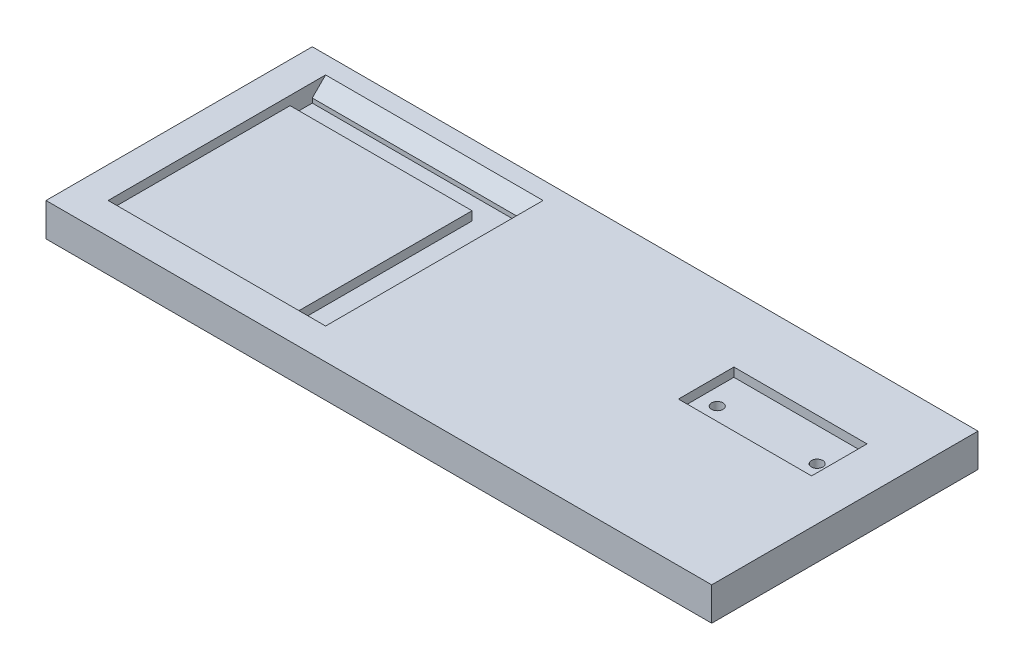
ISO-10303-21;
HEADER;
FILE_DESCRIPTION(('STEP AP214'),'2;1');
FILE_NAME('part.step','',(''),(''),'','','');
FILE_SCHEMA(('AUTOMOTIVE_DESIGN { 1 0 10303 214 1 1 1 1 }'));
ENDSEC;
DATA;
#1=APPLICATION_CONTEXT('core data for automotive mechanical design processes');
#2=APPLICATION_PROTOCOL_DEFINITION('international standard','automotive_design',2000,#1);
#3=PRODUCT_CONTEXT('',#1,'mechanical');
#4=PRODUCT('Part','Part','',(#3));
#5=PRODUCT_RELATED_PRODUCT_CATEGORY('part','',(#4));
#6=PRODUCT_DEFINITION_FORMATION('','',#4);
#7=PRODUCT_DEFINITION_CONTEXT('part definition',#1,'design');
#8=PRODUCT_DEFINITION('design','',#6,#7);
#9=PRODUCT_DEFINITION_SHAPE('','',#8);
#10=(LENGTH_UNIT() NAMED_UNIT(*) SI_UNIT(.MILLI.,.METRE.));
#11=(NAMED_UNIT(*) PLANE_ANGLE_UNIT() SI_UNIT($,.RADIAN.));
#12=(NAMED_UNIT(*) SI_UNIT($,.STERADIAN.) SOLID_ANGLE_UNIT());
#13=UNCERTAINTY_MEASURE_WITH_UNIT(LENGTH_MEASURE(1.E-05),#10,'distance_accuracy_value','');
#14=(GEOMETRIC_REPRESENTATION_CONTEXT(3) GLOBAL_UNCERTAINTY_ASSIGNED_CONTEXT((#13)) GLOBAL_UNIT_ASSIGNED_CONTEXT((#10,
#11,#12)) REPRESENTATION_CONTEXT('',''));
#15=CARTESIAN_POINT('',(0.,0.,0.));
#16=DIRECTION('',(0.,0.,1.));
#17=DIRECTION('',(1.,0.,0.));
#18=AXIS2_PLACEMENT_3D('',#15,#16,#17);
#19=CARTESIAN_POINT('',(190.5,19.05,-76.2));
#20=DIRECTION('',(0.,-1.,0.));
#21=DIRECTION('',(0.,0.,-1.));
#22=AXIS2_PLACEMENT_3D('',#19,#20,#21);
#23=PLANE('',#22);
#24=DIRECTION('',(-1.,0.,0.));
#25=VECTOR('',#24,1.);
#26=CARTESIAN_POINT('',(88.8999999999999,19.05,-38.1));
#27=LINE('',#26,#25);
#28=CARTESIAN_POINT('',(165.1,19.05,-38.1));
#29=VERTEX_POINT('',#28);
#30=CARTESIAN_POINT('',(88.8999999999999,19.05,-38.1));
#31=VERTEX_POINT('',#30);
#32=EDGE_CURVE('E257',#29,#31,#27,.T.);
#33=ORIENTED_EDGE('',*,*,#32,.F.);
#34=DIRECTION('',(0.,0.,-1.));
#35=VECTOR('',#34,1.);
#36=CARTESIAN_POINT('',(165.1,19.05,-6.35000000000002));
#37=LINE('',#36,#35);
#38=CARTESIAN_POINT('',(165.1,19.05,-6.35000000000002));
#39=VERTEX_POINT('',#38);
#40=EDGE_CURVE('E255',#39,#29,#37,.T.);
#41=ORIENTED_EDGE('',*,*,#40,.F.);
#42=DIRECTION('',(1.,0.,0.));
#43=VECTOR('',#42,1.);
#44=CARTESIAN_POINT('',(88.8999999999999,19.05,-6.35000000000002));
#45=LINE('',#44,#43);
#46=CARTESIAN_POINT('',(88.8999999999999,19.05,-6.35000000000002));
#47=VERTEX_POINT('',#46);
#48=EDGE_CURVE('E243',#47,#39,#45,.T.);
#49=ORIENTED_EDGE('',*,*,#48,.F.);
#50=DIRECTION('',(0.,0.,1.));
#51=VECTOR('',#50,1.);
#52=CARTESIAN_POINT('',(88.8999999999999,19.05,-6.35000000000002));
#53=LINE('',#52,#51);
#54=EDGE_CURVE('E261',#31,#47,#53,.T.);
#55=ORIENTED_EDGE('',*,*,#54,.F.);
#56=EDGE_LOOP('',(#33,#41,#49,#55));
#57=FACE_BOUND('',#56,.T.);
#58=DIRECTION('',(0.,0.,-1.));
#59=VECTOR('',#58,1.);
#60=CARTESIAN_POINT('',(190.5,19.05,76.2));
#61=LINE('',#60,#59);
#62=CARTESIAN_POINT('',(190.5,19.05,76.2));
#63=VERTEX_POINT('',#62);
#64=CARTESIAN_POINT('',(190.5,19.05,-76.2));
#65=VERTEX_POINT('',#64);
#66=EDGE_CURVE('E278',#63,#65,#61,.T.);
#67=ORIENTED_EDGE('',*,*,#66,.T.);
#68=DIRECTION('',(-1.,0.,0.));
#69=VECTOR('',#68,1.);
#70=CARTESIAN_POINT('',(-190.5,19.05,-76.2));
#71=LINE('',#70,#69);
#72=CARTESIAN_POINT('',(-190.5,19.05,-76.2));
#73=VERTEX_POINT('',#72);
#74=EDGE_CURVE('E281',#65,#73,#71,.T.);
#75=ORIENTED_EDGE('',*,*,#74,.T.);
#76=DIRECTION('',(0.,0.,1.));
#77=VECTOR('',#76,1.);
#78=CARTESIAN_POINT('',(-190.5,19.05,76.2));
#79=LINE('',#78,#77);
#80=CARTESIAN_POINT('',(-190.5,19.05,76.2));
#81=VERTEX_POINT('',#80);
#82=EDGE_CURVE('E284',#73,#81,#79,.T.);
#83=ORIENTED_EDGE('',*,*,#82,.T.);
#84=DIRECTION('',(1.,0.,0.));
#85=VECTOR('',#84,1.);
#86=CARTESIAN_POINT('',(-190.5,19.05,76.2));
#87=LINE('',#86,#85);
#88=EDGE_CURVE('E286',#81,#63,#87,.T.);
#89=ORIENTED_EDGE('',*,*,#88,.T.);
#90=EDGE_LOOP('',(#67,#75,#83,#89));
#91=FACE_BOUND('',#90,.T.);
#92=DIRECTION('',(0.,0.,1.));
#93=VECTOR('',#92,1.);
#94=CARTESIAN_POINT('',(-48.26,19.05,-76.2));
#95=LINE('',#94,#93);
#96=CARTESIAN_POINT('',(-48.26,19.05,-66.04));
#97=VERTEX_POINT('',#96);
#98=CARTESIAN_POINT('',(-48.26,19.05,58.42));
#99=VERTEX_POINT('',#98);
#100=EDGE_CURVE('E316',#97,#99,#95,.T.);
#101=ORIENTED_EDGE('',*,*,#100,.T.);
#102=DIRECTION('',(1.,0.,0.));
#103=VECTOR('',#102,1.);
#104=CARTESIAN_POINT('',(-319.318472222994,19.05,58.42));
#105=LINE('',#104,#103);
#106=CARTESIAN_POINT('',(-172.72,19.05,58.42));
#107=VERTEX_POINT('',#106);
#108=EDGE_CURVE('E65',#107,#99,#105,.T.);
#109=ORIENTED_EDGE('',*,*,#108,.F.);
#110=DIRECTION('',(0.,0.,-1.));
#111=VECTOR('',#110,1.);
#112=CARTESIAN_POINT('',(-172.72,19.05,0.));
#113=LINE('',#112,#111);
#114=CARTESIAN_POINT('',(-172.72,19.05,-66.04));
#115=VERTEX_POINT('',#114);
#116=EDGE_CURVE('E196',#107,#115,#113,.T.);
#117=ORIENTED_EDGE('',*,*,#116,.T.);
#118=DIRECTION('',(1.,0.,0.));
#119=VECTOR('',#118,1.);
#120=CARTESIAN_POINT('',(-55.88,19.05,-66.04));
#121=LINE('',#120,#119);
#122=EDGE_CURVE('E314',#115,#97,#121,.T.);
#123=ORIENTED_EDGE('',*,*,#122,.T.);
#124=EDGE_LOOP('',(#101,#109,#117,#123));
#125=FACE_BOUND('',#124,.T.);
#126=ADVANCED_FACE('F41',(#57,#91,#125),#23,.F.);
#127=CARTESIAN_POINT('',(190.5,19.05,76.2));
#128=DIRECTION('',(-1.,0.,0.));
#129=DIRECTION('',(0.,0.,1.));
#130=AXIS2_PLACEMENT_3D('',#127,#128,#129);
#131=PLANE('',#130);
#132=DIRECTION('',(0.,0.,-1.));
#133=VECTOR('',#132,1.);
#134=CARTESIAN_POINT('',(190.5,0.,76.2));
#135=LINE('',#134,#133);
#136=CARTESIAN_POINT('',(190.5,0.,76.2));
#137=VERTEX_POINT('',#136);
#138=CARTESIAN_POINT('',(190.5,0.,-76.2));
#139=VERTEX_POINT('',#138);
#140=EDGE_CURVE('E270',#137,#139,#135,.T.);
#141=ORIENTED_EDGE('',*,*,#140,.T.);
#142=DIRECTION('',(0.,-1.,0.));
#143=VECTOR('',#142,1.);
#144=CARTESIAN_POINT('',(190.5,19.05,-76.2));
#145=LINE('',#144,#143);
#146=EDGE_CURVE('E304',#65,#139,#145,.T.);
#147=ORIENTED_EDGE('',*,*,#146,.F.);
#148=ORIENTED_EDGE('',*,*,#66,.F.);
#149=DIRECTION('',(0.,-1.,0.));
#150=VECTOR('',#149,1.);
#151=CARTESIAN_POINT('',(190.5,19.05,76.2));
#152=LINE('',#151,#150);
#153=EDGE_CURVE('E288',#63,#137,#152,.T.);
#154=ORIENTED_EDGE('',*,*,#153,.T.);
#155=EDGE_LOOP('',(#141,#147,#148,#154));
#156=FACE_BOUND('',#155,.T.);
#157=ADVANCED_FACE('F351',(#156),#131,.F.);
#158=CARTESIAN_POINT('',(-190.5,19.05,-76.2));
#159=DIRECTION('',(0.,0.,1.));
#160=DIRECTION('',(1.,0.,0.));
#161=AXIS2_PLACEMENT_3D('',#158,#159,#160);
#162=PLANE('',#161);
#163=DIRECTION('',(-1.,0.,0.));
#164=VECTOR('',#163,1.);
#165=CARTESIAN_POINT('',(-190.5,0.,-76.2));
#166=LINE('',#165,#164);
#167=CARTESIAN_POINT('',(-190.5,0.,-76.2));
#168=VERTEX_POINT('',#167);
#169=EDGE_CURVE('E291',#139,#168,#166,.T.);
#170=ORIENTED_EDGE('',*,*,#169,.T.);
#171=DIRECTION('',(0.,-1.,0.));
#172=VECTOR('',#171,1.);
#173=CARTESIAN_POINT('',(-190.5,19.05,-76.2));
#174=LINE('',#173,#172);
#175=EDGE_CURVE('E301',#73,#168,#174,.T.);
#176=ORIENTED_EDGE('',*,*,#175,.F.);
#177=ORIENTED_EDGE('',*,*,#74,.F.);
#178=ORIENTED_EDGE('',*,*,#146,.T.);
#179=EDGE_LOOP('',(#170,#176,#177,#178));
#180=FACE_BOUND('',#179,.T.);
#181=ADVANCED_FACE('F357',(#180),#162,.F.);
#182=CARTESIAN_POINT('',(-190.5,19.05,76.2));
#183=DIRECTION('',(1.,0.,0.));
#184=DIRECTION('',(0.,0.,-1.));
#185=AXIS2_PLACEMENT_3D('',#182,#183,#184);
#186=PLANE('',#185);
#187=DIRECTION('',(0.,0.,1.));
#188=VECTOR('',#187,1.);
#189=CARTESIAN_POINT('',(-190.5,0.,76.2));
#190=LINE('',#189,#188);
#191=CARTESIAN_POINT('',(-190.5,0.,76.2));
#192=VERTEX_POINT('',#191);
#193=EDGE_CURVE('E293',#168,#192,#190,.T.);
#194=ORIENTED_EDGE('',*,*,#193,.T.);
#195=DIRECTION('',(0.,-1.,0.));
#196=VECTOR('',#195,1.);
#197=CARTESIAN_POINT('',(-190.5,19.05,76.2));
#198=LINE('',#197,#196);
#199=EDGE_CURVE('E298',#81,#192,#198,.T.);
#200=ORIENTED_EDGE('',*,*,#199,.F.);
#201=ORIENTED_EDGE('',*,*,#82,.F.);
#202=ORIENTED_EDGE('',*,*,#175,.T.);
#203=EDGE_LOOP('',(#194,#200,#201,#202));
#204=FACE_BOUND('',#203,.T.);
#205=ADVANCED_FACE('F373',(#204),#186,.F.);
#206=CARTESIAN_POINT('',(-190.5,19.05,76.2));
#207=DIRECTION('',(0.,0.,-1.));
#208=DIRECTION('',(-1.,0.,0.));
#209=AXIS2_PLACEMENT_3D('',#206,#207,#208);
#210=PLANE('',#209);
#211=DIRECTION('',(1.,0.,0.));
#212=VECTOR('',#211,1.);
#213=CARTESIAN_POINT('',(-190.5,0.,76.2));
#214=LINE('',#213,#212);
#215=EDGE_CURVE('E282',#192,#137,#214,.T.);
#216=ORIENTED_EDGE('',*,*,#215,.T.);
#217=ORIENTED_EDGE('',*,*,#153,.F.);
#218=ORIENTED_EDGE('',*,*,#88,.F.);
#219=ORIENTED_EDGE('',*,*,#199,.T.);
#220=EDGE_LOOP('',(#216,#217,#218,#219));
#221=FACE_BOUND('',#220,.T.);
#222=ADVANCED_FACE('F369',(#221),#210,.F.);
#223=CARTESIAN_POINT('',(190.5,0.,-76.2));
#224=DIRECTION('',(0.,-1.,0.));
#225=DIRECTION('',(0.,0.,-1.));
#226=AXIS2_PLACEMENT_3D('',#223,#224,#225);
#227=PLANE('',#226);
#228=CARTESIAN_POINT('',(155.575,0.,-19.05));
#229=DIRECTION('',(0.,-1.,0.));
#230=DIRECTION('',(0.,0.,-1.));
#231=AXIS2_PLACEMENT_3D('',#228,#229,#230);
#232=CIRCLE('',#231,7.14375);
#233=CARTESIAN_POINT('',(155.575,0.,-26.19375));
#234=VERTEX_POINT('',#233);
#235=EDGE_CURVE('E218',#234,#234,#232,.T.);
#236=ORIENTED_EDGE('',*,*,#235,.F.);
#237=EDGE_LOOP('',(#236));
#238=FACE_BOUND('',#237,.T.);
#239=CARTESIAN_POINT('',(98.4249999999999,0.,-19.05));
#240=DIRECTION('',(0.,-1.,0.));
#241=DIRECTION('',(0.,0.,-1.));
#242=AXIS2_PLACEMENT_3D('',#239,#240,#241);
#243=CIRCLE('',#242,7.14375);
#244=CARTESIAN_POINT('',(98.4249999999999,0.,-26.19375));
#245=VERTEX_POINT('',#244);
#246=EDGE_CURVE('E229',#245,#245,#243,.T.);
#247=ORIENTED_EDGE('',*,*,#246,.F.);
#248=EDGE_LOOP('',(#247));
#249=FACE_BOUND('',#248,.T.);
#250=ORIENTED_EDGE('',*,*,#140,.F.);
#251=ORIENTED_EDGE('',*,*,#215,.F.);
#252=ORIENTED_EDGE('',*,*,#193,.F.);
#253=ORIENTED_EDGE('',*,*,#169,.F.);
#254=EDGE_LOOP('',(#250,#251,#252,#253));
#255=FACE_BOUND('',#254,.T.);
#256=ADVANCED_FACE('F366',(#238,#249,#255),#227,.T.);
#257=CARTESIAN_POINT('',(165.1,13.97,-6.35000000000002));
#258=DIRECTION('',(1.,0.,0.));
#259=DIRECTION('',(0.,0.,-1.));
#260=AXIS2_PLACEMENT_3D('',#257,#258,#259);
#261=PLANE('',#260);
#262=ORIENTED_EDGE('',*,*,#40,.T.);
#263=DIRECTION('',(0.,1.,0.));
#264=VECTOR('',#263,1.);
#265=CARTESIAN_POINT('',(165.1,13.97,-38.1));
#266=LINE('',#265,#264);
#267=CARTESIAN_POINT('',(165.1,13.97,-38.1));
#268=VERTEX_POINT('',#267);
#269=EDGE_CURVE('E254',#268,#29,#266,.T.);
#270=ORIENTED_EDGE('',*,*,#269,.F.);
#271=DIRECTION('',(0.,0.,-1.));
#272=VECTOR('',#271,1.);
#273=CARTESIAN_POINT('',(165.1,13.97,-6.35000000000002));
#274=LINE('',#273,#272);
#275=CARTESIAN_POINT('',(165.1,13.97,-6.35000000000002));
#276=VERTEX_POINT('',#275);
#277=EDGE_CURVE('E239',#276,#268,#274,.T.);
#278=ORIENTED_EDGE('',*,*,#277,.F.);
#279=DIRECTION('',(0.,1.,0.));
#280=VECTOR('',#279,1.);
#281=CARTESIAN_POINT('',(165.1,13.97,-6.35000000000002));
#282=LINE('',#281,#280);
#283=EDGE_CURVE('E268',#276,#39,#282,.T.);
#284=ORIENTED_EDGE('',*,*,#283,.T.);
#285=EDGE_LOOP('',(#262,#270,#278,#284));
#286=FACE_BOUND('',#285,.T.);
#287=ADVANCED_FACE('F364',(#286),#261,.F.);
#288=CARTESIAN_POINT('',(88.8999999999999,13.97,-6.35000000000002));
#289=DIRECTION('',(0.,0.,1.));
#290=DIRECTION('',(1.,0.,0.));
#291=AXIS2_PLACEMENT_3D('',#288,#289,#290);
#292=PLANE('',#291);
#293=ORIENTED_EDGE('',*,*,#48,.T.);
#294=ORIENTED_EDGE('',*,*,#283,.F.);
#295=DIRECTION('',(1.,0.,0.));
#296=VECTOR('',#295,1.);
#297=CARTESIAN_POINT('',(88.8999999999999,13.97,-6.35000000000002));
#298=LINE('',#297,#296);
#299=CARTESIAN_POINT('',(88.8999999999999,13.97,-6.35000000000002));
#300=VERTEX_POINT('',#299);
#301=EDGE_CURVE('E250',#300,#276,#298,.T.);
#302=ORIENTED_EDGE('',*,*,#301,.F.);
#303=DIRECTION('',(0.,1.,0.));
#304=VECTOR('',#303,1.);
#305=CARTESIAN_POINT('',(88.8999999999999,13.97,-6.35000000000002));
#306=LINE('',#305,#304);
#307=EDGE_CURVE('E271',#300,#47,#306,.T.);
#308=ORIENTED_EDGE('',*,*,#307,.T.);
#309=EDGE_LOOP('',(#293,#294,#302,#308));
#310=FACE_BOUND('',#309,.T.);
#311=ADVANCED_FACE('F546',(#310),#292,.F.);
#312=CARTESIAN_POINT('',(88.8999999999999,13.97,-6.35000000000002));
#313=DIRECTION('',(-1.,0.,0.));
#314=DIRECTION('',(0.,0.,1.));
#315=AXIS2_PLACEMENT_3D('',#312,#313,#314);
#316=PLANE('',#315);
#317=ORIENTED_EDGE('',*,*,#54,.T.);
#318=ORIENTED_EDGE('',*,*,#307,.F.);
#319=DIRECTION('',(0.,0.,1.));
#320=VECTOR('',#319,1.);
#321=CARTESIAN_POINT('',(88.8999999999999,13.97,-6.35000000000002));
#322=LINE('',#321,#320);
#323=CARTESIAN_POINT('',(88.8999999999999,13.97,-38.1));
#324=VERTEX_POINT('',#323);
#325=EDGE_CURVE('E247',#324,#300,#322,.T.);
#326=ORIENTED_EDGE('',*,*,#325,.F.);
#327=DIRECTION('',(0.,1.,0.));
#328=VECTOR('',#327,1.);
#329=CARTESIAN_POINT('',(88.8999999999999,13.97,-38.1));
#330=LINE('',#329,#328);
#331=EDGE_CURVE('E273',#324,#31,#330,.T.);
#332=ORIENTED_EDGE('',*,*,#331,.T.);
#333=EDGE_LOOP('',(#317,#318,#326,#332));
#334=FACE_BOUND('',#333,.T.);
#335=ADVANCED_FACE('F537',(#334),#316,.F.);
#336=CARTESIAN_POINT('',(88.8999999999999,13.97,-38.1));
#337=DIRECTION('',(0.,0.,-1.));
#338=DIRECTION('',(-1.,0.,0.));
#339=AXIS2_PLACEMENT_3D('',#336,#337,#338);
#340=PLANE('',#339);
#341=ORIENTED_EDGE('',*,*,#32,.T.);
#342=ORIENTED_EDGE('',*,*,#331,.F.);
#343=DIRECTION('',(-1.,0.,0.));
#344=VECTOR('',#343,1.);
#345=CARTESIAN_POINT('',(88.8999999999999,13.97,-38.1));
#346=LINE('',#345,#344);
#347=EDGE_CURVE('E242',#268,#324,#346,.T.);
#348=ORIENTED_EDGE('',*,*,#347,.F.);
#349=ORIENTED_EDGE('',*,*,#269,.T.);
#350=EDGE_LOOP('',(#341,#342,#348,#349));
#351=FACE_BOUND('',#350,.T.);
#352=ADVANCED_FACE('F521',(#351),#340,.F.);
#353=CARTESIAN_POINT('',(165.1,13.97,-38.1));
#354=DIRECTION('',(0.,-1.,0.));
#355=DIRECTION('',(0.,0.,-1.));
#356=AXIS2_PLACEMENT_3D('',#353,#354,#355);
#357=PLANE('',#356);
#358=CARTESIAN_POINT('',(155.575,13.97,-19.05));
#359=DIRECTION('',(0.,-1.,0.));
#360=DIRECTION('',(0.,0.,-1.));
#361=AXIS2_PLACEMENT_3D('',#358,#359,#360);
#362=CIRCLE('',#361,3.2639);
#363=CARTESIAN_POINT('',(155.575,13.97,-22.3139));
#364=VERTEX_POINT('',#363);
#365=EDGE_CURVE('E228',#364,#364,#362,.T.);
#366=ORIENTED_EDGE('',*,*,#365,.T.);
#367=EDGE_LOOP('',(#366));
#368=FACE_BOUND('',#367,.T.);
#369=CARTESIAN_POINT('',(98.4249999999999,13.97,-19.05));
#370=DIRECTION('',(0.,-1.,0.));
#371=DIRECTION('',(0.,0.,-1.));
#372=AXIS2_PLACEMENT_3D('',#369,#370,#371);
#373=CIRCLE('',#372,3.2639);
#374=CARTESIAN_POINT('',(98.4249999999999,13.97,-22.3139));
#375=VERTEX_POINT('',#374);
#376=EDGE_CURVE('E238',#375,#375,#373,.T.);
#377=ORIENTED_EDGE('',*,*,#376,.T.);
#378=EDGE_LOOP('',(#377));
#379=FACE_BOUND('',#378,.T.);
#380=ORIENTED_EDGE('',*,*,#277,.T.);
#381=ORIENTED_EDGE('',*,*,#347,.T.);
#382=ORIENTED_EDGE('',*,*,#325,.T.);
#383=ORIENTED_EDGE('',*,*,#301,.T.);
#384=EDGE_LOOP('',(#380,#381,#382,#383));
#385=FACE_BOUND('',#384,.T.);
#386=ADVANCED_FACE('F510',(#368,#379,#385),#357,.F.);
#387=CARTESIAN_POINT('',(98.4249999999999,0.,-19.05));
#388=DIRECTION('',(0.,-1.,0.));
#389=DIRECTION('',(0.,0.,-1.));
#390=AXIS2_PLACEMENT_3D('',#387,#388,#389);
#391=CYLINDRICAL_SURFACE('',#390,3.2639);
#392=CARTESIAN_POINT('',(98.4249999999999,4.191,-19.05));
#393=DIRECTION('',(0.,-1.,0.));
#394=DIRECTION('',(0.,0.,-1.));
#395=AXIS2_PLACEMENT_3D('',#392,#393,#394);
#396=CIRCLE('',#395,3.2639);
#397=CARTESIAN_POINT('',(98.4249999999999,4.191,-22.3139));
#398=VERTEX_POINT('',#397);
#399=EDGE_CURVE('E235',#398,#398,#396,.T.);
#400=ORIENTED_EDGE('',*,*,#399,.T.);
#401=EDGE_LOOP('',(#400));
#402=FACE_BOUND('',#401,.T.);
#403=ORIENTED_EDGE('',*,*,#376,.F.);
#404=EDGE_LOOP('',(#403));
#405=FACE_BOUND('',#404,.T.);
#406=ADVANCED_FACE('F500',(#402,#405),#391,.F.);
#407=CARTESIAN_POINT('',(101.6889,4.191,-19.05));
#408=DIRECTION('',(0.,1.,0.));
#409=DIRECTION('',(0.,0.,1.));
#410=AXIS2_PLACEMENT_3D('',#407,#408,#409);
#411=PLANE('',#410);
#412=ORIENTED_EDGE('',*,*,#399,.F.);
#413=EDGE_LOOP('',(#412));
#414=FACE_BOUND('',#413,.T.);
#415=CARTESIAN_POINT('',(98.4249999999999,4.191,-19.05));
#416=DIRECTION('',(0.,-1.,0.));
#417=DIRECTION('',(0.,0.,-1.));
#418=AXIS2_PLACEMENT_3D('',#415,#416,#417);
#419=CIRCLE('',#418,7.14375);
#420=CARTESIAN_POINT('',(98.4249999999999,4.191,-26.19375));
#421=VERTEX_POINT('',#420);
#422=EDGE_CURVE('E232',#421,#421,#419,.T.);
#423=ORIENTED_EDGE('',*,*,#422,.T.);
#424=EDGE_LOOP('',(#423));
#425=FACE_BOUND('',#424,.T.);
#426=ADVANCED_FACE('F490',(#414,#425),#411,.F.);
#427=CARTESIAN_POINT('',(98.4249999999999,0.,-19.05));
#428=DIRECTION('',(0.,-1.,0.));
#429=DIRECTION('',(0.,0.,-1.));
#430=AXIS2_PLACEMENT_3D('',#427,#428,#429);
#431=CYLINDRICAL_SURFACE('',#430,7.14375);
#432=ORIENTED_EDGE('',*,*,#422,.F.);
#433=EDGE_LOOP('',(#432));
#434=FACE_BOUND('',#433,.T.);
#435=ORIENTED_EDGE('',*,*,#246,.T.);
#436=EDGE_LOOP('',(#435));
#437=FACE_BOUND('',#436,.T.);
#438=ADVANCED_FACE('F480',(#434,#437),#431,.F.);
#439=CARTESIAN_POINT('',(155.575,0.,-19.05));
#440=DIRECTION('',(0.,-1.,0.));
#441=DIRECTION('',(0.,0.,-1.));
#442=AXIS2_PLACEMENT_3D('',#439,#440,#441);
#443=CYLINDRICAL_SURFACE('',#442,3.2639);
#444=CARTESIAN_POINT('',(155.575,4.191,-19.05));
#445=DIRECTION('',(0.,-1.,0.));
#446=DIRECTION('',(0.,0.,-1.));
#447=AXIS2_PLACEMENT_3D('',#444,#445,#446);
#448=CIRCLE('',#447,3.26390000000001);
#449=CARTESIAN_POINT('',(155.575,4.191,-22.3139));
#450=VERTEX_POINT('',#449);
#451=EDGE_CURVE('E225',#450,#450,#448,.T.);
#452=ORIENTED_EDGE('',*,*,#451,.T.);
#453=EDGE_LOOP('',(#452));
#454=FACE_BOUND('',#453,.T.);
#455=ORIENTED_EDGE('',*,*,#365,.F.);
#456=EDGE_LOOP('',(#455));
#457=FACE_BOUND('',#456,.T.);
#458=ADVANCED_FACE('F470',(#454,#457),#443,.F.);
#459=CARTESIAN_POINT('',(158.8389,4.191,-19.05));
#460=DIRECTION('',(0.,1.,0.));
#461=DIRECTION('',(0.,0.,1.));
#462=AXIS2_PLACEMENT_3D('',#459,#460,#461);
#463=PLANE('',#462);
#464=ORIENTED_EDGE('',*,*,#451,.F.);
#465=EDGE_LOOP('',(#464));
#466=FACE_BOUND('',#465,.T.);
#467=CARTESIAN_POINT('',(155.575,4.191,-19.05));
#468=DIRECTION('',(0.,-1.,0.));
#469=DIRECTION('',(0.,0.,-1.));
#470=AXIS2_PLACEMENT_3D('',#467,#468,#469);
#471=CIRCLE('',#470,7.14375);
#472=CARTESIAN_POINT('',(155.575,4.191,-26.19375));
#473=VERTEX_POINT('',#472);
#474=EDGE_CURVE('E222',#473,#473,#471,.T.);
#475=ORIENTED_EDGE('',*,*,#474,.T.);
#476=EDGE_LOOP('',(#475));
#477=FACE_BOUND('',#476,.T.);
#478=ADVANCED_FACE('F460',(#466,#477),#463,.F.);
#479=CARTESIAN_POINT('',(155.575,0.,-19.05));
#480=DIRECTION('',(0.,-1.,0.));
#481=DIRECTION('',(0.,0.,-1.));
#482=AXIS2_PLACEMENT_3D('',#479,#480,#481);
#483=CYLINDRICAL_SURFACE('',#482,7.14375);
#484=ORIENTED_EDGE('',*,*,#474,.F.);
#485=EDGE_LOOP('',(#484));
#486=FACE_BOUND('',#485,.T.);
#487=ORIENTED_EDGE('',*,*,#235,.T.);
#488=EDGE_LOOP('',(#487));
#489=FACE_BOUND('',#488,.T.);
#490=ADVANCED_FACE('F429',(#486,#489),#483,.F.);
#491=CARTESIAN_POINT('',(-319.318472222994,13.97,58.42));
#492=DIRECTION('',(0.,0.,1.));
#493=DIRECTION('',(1.,0.,0.));
#494=AXIS2_PLACEMENT_3D('',#491,#492,#493);
#495=PLANE('',#494);
#496=ORIENTED_EDGE('',*,*,#108,.T.);
#497=DIRECTION('',(0.707106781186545,0.70710678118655,0.));
#498=VECTOR('',#497,1.);
#499=CARTESIAN_POINT('',(-186.329236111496,-119.019236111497,58.42));
#500=LINE('',#499,#498);
#501=CARTESIAN_POINT('',(-55.88,11.4299999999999,58.42));
#502=VERTEX_POINT('',#501);
#503=EDGE_CURVE('E50',#99,#502,#500,.F.);
#504=ORIENTED_EDGE('',*,*,#503,.T.);
#505=DIRECTION('',(0.,1.,0.));
#506=VECTOR('',#505,1.);
#507=CARTESIAN_POINT('',(-55.88,8.89,58.42));
#508=LINE('',#507,#506);
#509=CARTESIAN_POINT('',(-55.88,8.89,58.42));
#510=VERTEX_POINT('',#509);
#511=EDGE_CURVE('E201',#510,#502,#508,.T.);
#512=ORIENTED_EDGE('',*,*,#511,.F.);
#513=DIRECTION('',(1.,0.,0.));
#514=VECTOR('',#513,1.);
#515=CARTESIAN_POINT('',(-319.318472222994,8.89,58.42));
#516=LINE('',#515,#514);
#517=CARTESIAN_POINT('',(-68.58,8.89,58.42));
#518=VERTEX_POINT('',#517);
#519=EDGE_CURVE('E180',#518,#510,#516,.T.);
#520=ORIENTED_EDGE('',*,*,#519,.F.);
#521=DIRECTION('',(0.,1.,0.));
#522=VECTOR('',#521,1.);
#523=CARTESIAN_POINT('',(-68.58,8.89,58.42));
#524=LINE('',#523,#522);
#525=CARTESIAN_POINT('',(-68.58,13.97,58.42));
#526=VERTEX_POINT('',#525);
#527=EDGE_CURVE('E170',#518,#526,#524,.T.);
#528=ORIENTED_EDGE('',*,*,#527,.T.);
#529=DIRECTION('',(1.,0.,0.));
#530=VECTOR('',#529,1.);
#531=CARTESIAN_POINT('',(-319.318472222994,13.97,58.42));
#532=LINE('',#531,#530);
#533=CARTESIAN_POINT('',(-172.72,13.97,58.42));
#534=VERTEX_POINT('',#533);
#535=EDGE_CURVE('E211',#534,#526,#532,.T.);
#536=ORIENTED_EDGE('',*,*,#535,.F.);
#537=DIRECTION('',(0.,1.,0.));
#538=VECTOR('',#537,1.);
#539=CARTESIAN_POINT('',(-172.72,13.97,58.42));
#540=LINE('',#539,#538);
#541=EDGE_CURVE('E214',#534,#107,#540,.T.);
#542=ORIENTED_EDGE('',*,*,#541,.T.);
#543=EDGE_LOOP('',(#496,#504,#512,#520,#528,#536,#542));
#544=FACE_BOUND('',#543,.T.);
#545=ADVANCED_FACE('F320',(#544),#495,.F.);
#546=CARTESIAN_POINT('',(-172.72,13.97,0.));
#547=DIRECTION('',(1.,0.,0.));
#548=DIRECTION('',(0.,0.,-1.));
#549=AXIS2_PLACEMENT_3D('',#546,#547,#548);
#550=PLANE('',#549);
#551=ORIENTED_EDGE('',*,*,#116,.F.);
#552=ORIENTED_EDGE('',*,*,#541,.F.);
#553=DIRECTION('',(0.,0.,-1.));
#554=VECTOR('',#553,1.);
#555=CARTESIAN_POINT('',(-172.72,13.97,0.));
#556=LINE('',#555,#554);
#557=CARTESIAN_POINT('',(-172.72,13.97,-45.72));
#558=VERTEX_POINT('',#557);
#559=EDGE_CURVE('E208',#534,#558,#556,.T.);
#560=ORIENTED_EDGE('',*,*,#559,.T.);
#561=DIRECTION('',(0.,1.,0.));
#562=VECTOR('',#561,1.);
#563=CARTESIAN_POINT('',(-172.72,8.89,-45.72));
#564=LINE('',#563,#562);
#565=CARTESIAN_POINT('',(-172.72,8.89,-45.72));
#566=VERTEX_POINT('',#565);
#567=EDGE_CURVE('E194',#566,#558,#564,.T.);
#568=ORIENTED_EDGE('',*,*,#567,.F.);
#569=DIRECTION('',(0.,0.,-1.));
#570=VECTOR('',#569,1.);
#571=CARTESIAN_POINT('',(-172.72,8.89,0.));
#572=LINE('',#571,#570);
#573=CARTESIAN_POINT('',(-172.72,8.89,-58.42));
#574=VERTEX_POINT('',#573);
#575=EDGE_CURVE('E171',#566,#574,#572,.T.);
#576=ORIENTED_EDGE('',*,*,#575,.T.);
#577=DIRECTION('',(0.,1.,0.));
#578=VECTOR('',#577,1.);
#579=CARTESIAN_POINT('',(-172.72,8.89,-58.42));
#580=LINE('',#579,#578);
#581=CARTESIAN_POINT('',(-172.72,11.4299999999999,-58.42));
#582=VERTEX_POINT('',#581);
#583=EDGE_CURVE('E197',#574,#582,#580,.T.);
#584=ORIENTED_EDGE('',*,*,#583,.T.);
#585=DIRECTION('',(0.,0.70710678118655,-0.707106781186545));
#586=VECTOR('',#585,1.);
#587=CARTESIAN_POINT('',(-172.72,19.05,-66.04));
#588=LINE('',#587,#586);
#589=EDGE_CURVE('E11',#582,#115,#588,.T.);
#590=ORIENTED_EDGE('',*,*,#589,.T.);
#591=EDGE_LOOP('',(#551,#552,#560,#568,#576,#584,#590));
#592=FACE_BOUND('',#591,.T.);
#593=ADVANCED_FACE('F335',(#592),#550,.T.);
#594=CARTESIAN_POINT('',(-319.318472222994,13.97,0.));
#595=DIRECTION('',(0.,1.,0.));
#596=DIRECTION('',(0.,0.,1.));
#597=AXIS2_PLACEMENT_3D('',#594,#595,#596);
#598=PLANE('',#597);
#599=DIRECTION('',(0.,0.,1.));
#600=VECTOR('',#599,1.);
#601=CARTESIAN_POINT('',(-68.58,13.97,0.));
#602=LINE('',#601,#600);
#603=CARTESIAN_POINT('',(-68.58,13.97,-45.72));
#604=VERTEX_POINT('',#603);
#605=EDGE_CURVE('E205',#604,#526,#602,.T.);
#606=ORIENTED_EDGE('',*,*,#605,.F.);
#607=DIRECTION('',(1.,0.,0.));
#608=VECTOR('',#607,1.);
#609=CARTESIAN_POINT('',(-319.318472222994,13.97,-45.72));
#610=LINE('',#609,#608);
#611=EDGE_CURVE('E167',#558,#604,#610,.T.);
#612=ORIENTED_EDGE('',*,*,#611,.F.);
#613=ORIENTED_EDGE('',*,*,#559,.F.);
#614=ORIENTED_EDGE('',*,*,#535,.T.);
#615=EDGE_LOOP('',(#606,#612,#613,#614));
#616=FACE_BOUND('',#615,.T.);
#617=ADVANCED_FACE('F340',(#616),#598,.T.);
#618=CARTESIAN_POINT('',(-319.318472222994,8.89,-45.72));
#619=DIRECTION('',(0.,0.,1.));
#620=DIRECTION('',(1.,0.,0.));
#621=AXIS2_PLACEMENT_3D('',#618,#619,#620);
#622=PLANE('',#621);
#623=ORIENTED_EDGE('',*,*,#611,.T.);
#624=DIRECTION('',(0.,1.,0.));
#625=VECTOR('',#624,1.);
#626=CARTESIAN_POINT('',(-68.58,8.89,-45.72));
#627=LINE('',#626,#625);
#628=CARTESIAN_POINT('',(-68.58,8.89,-45.72));
#629=VERTEX_POINT('',#628);
#630=EDGE_CURVE('E161',#629,#604,#627,.T.);
#631=ORIENTED_EDGE('',*,*,#630,.F.);
#632=DIRECTION('',(1.,0.,0.));
#633=VECTOR('',#632,1.);
#634=CARTESIAN_POINT('',(-319.318472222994,8.89,-45.72));
#635=LINE('',#634,#633);
#636=EDGE_CURVE('E165',#566,#629,#635,.T.);
#637=ORIENTED_EDGE('',*,*,#636,.F.);
#638=ORIENTED_EDGE('',*,*,#567,.T.);
#639=EDGE_LOOP('',(#623,#631,#637,#638));
#640=FACE_BOUND('',#639,.T.);
#641=ADVANCED_FACE('F163',(#640),#622,.F.);
#642=CARTESIAN_POINT('',(-319.318472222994,8.89,-58.42));
#643=DIRECTION('',(0.,0.,1.));
#644=DIRECTION('',(1.,0.,0.));
#645=AXIS2_PLACEMENT_3D('',#642,#643,#644);
#646=PLANE('',#645);
#647=DIRECTION('',(0.,1.,0.));
#648=VECTOR('',#647,1.);
#649=CARTESIAN_POINT('',(-55.88,8.89,-58.42));
#650=LINE('',#649,#648);
#651=CARTESIAN_POINT('',(-55.88,8.89,-58.42));
#652=VERTEX_POINT('',#651);
#653=CARTESIAN_POINT('',(-55.88,11.4299999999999,-58.42));
#654=VERTEX_POINT('',#653);
#655=EDGE_CURVE('E199',#652,#654,#650,.T.);
#656=ORIENTED_EDGE('',*,*,#655,.T.);
#657=DIRECTION('',(-1.,0.,0.));
#658=VECTOR('',#657,1.);
#659=CARTESIAN_POINT('',(-172.72,11.4299999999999,-58.42));
#660=LINE('',#659,#658);
#661=EDGE_CURVE('E57',#654,#582,#660,.T.);
#662=ORIENTED_EDGE('',*,*,#661,.T.);
#663=ORIENTED_EDGE('',*,*,#583,.F.);
#664=DIRECTION('',(1.,0.,0.));
#665=VECTOR('',#664,1.);
#666=CARTESIAN_POINT('',(-319.318472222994,8.89,-58.42));
#667=LINE('',#666,#665);
#668=EDGE_CURVE('E191',#574,#652,#667,.T.);
#669=ORIENTED_EDGE('',*,*,#668,.T.);
#670=EDGE_LOOP('',(#656,#662,#663,#669));
#671=FACE_BOUND('',#670,.T.);
#672=ADVANCED_FACE('F336',(#671),#646,.T.);
#673=CARTESIAN_POINT('',(-55.88,8.89,0.));
#674=DIRECTION('',(1.,0.,0.));
#675=DIRECTION('',(0.,0.,-1.));
#676=AXIS2_PLACEMENT_3D('',#673,#674,#675);
#677=PLANE('',#676);
#678=ORIENTED_EDGE('',*,*,#511,.T.);
#679=DIRECTION('',(0.,0.,-1.));
#680=VECTOR('',#679,1.);
#681=CARTESIAN_POINT('',(-55.88,11.4299999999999,0.));
#682=LINE('',#681,#680);
#683=EDGE_CURVE('E307',#502,#654,#682,.T.);
#684=ORIENTED_EDGE('',*,*,#683,.T.);
#685=ORIENTED_EDGE('',*,*,#655,.F.);
#686=DIRECTION('',(0.,0.,-1.));
#687=VECTOR('',#686,1.);
#688=CARTESIAN_POINT('',(-55.88,8.89,0.));
#689=LINE('',#688,#687);
#690=EDGE_CURVE('E188',#510,#652,#689,.T.);
#691=ORIENTED_EDGE('',*,*,#690,.F.);
#692=EDGE_LOOP('',(#678,#684,#685,#691));
#693=FACE_BOUND('',#692,.T.);
#694=ADVANCED_FACE('F326',(#693),#677,.F.);
#695=CARTESIAN_POINT('',(-68.58,8.89,0.));
#696=DIRECTION('',(-1.,0.,0.));
#697=DIRECTION('',(0.,0.,1.));
#698=AXIS2_PLACEMENT_3D('',#695,#696,#697);
#699=PLANE('',#698);
#700=ORIENTED_EDGE('',*,*,#605,.T.);
#701=ORIENTED_EDGE('',*,*,#527,.F.);
#702=DIRECTION('',(0.,0.,1.));
#703=VECTOR('',#702,1.);
#704=CARTESIAN_POINT('',(-68.58,8.89,0.));
#705=LINE('',#704,#703);
#706=EDGE_CURVE('E174',#629,#518,#705,.T.);
#707=ORIENTED_EDGE('',*,*,#706,.F.);
#708=ORIENTED_EDGE('',*,*,#630,.T.);
#709=EDGE_LOOP('',(#700,#701,#707,#708));
#710=FACE_BOUND('',#709,.T.);
#711=ADVANCED_FACE('F175',(#710),#699,.F.);
#712=CARTESIAN_POINT('',(-319.318472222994,8.89,0.));
#713=DIRECTION('',(0.,1.,0.));
#714=DIRECTION('',(0.,0.,1.));
#715=AXIS2_PLACEMENT_3D('',#712,#713,#714);
#716=PLANE('',#715);
#717=ORIENTED_EDGE('',*,*,#636,.T.);
#718=ORIENTED_EDGE('',*,*,#706,.T.);
#719=ORIENTED_EDGE('',*,*,#519,.T.);
#720=ORIENTED_EDGE('',*,*,#690,.T.);
#721=ORIENTED_EDGE('',*,*,#668,.F.);
#722=ORIENTED_EDGE('',*,*,#575,.F.);
#723=EDGE_LOOP('',(#717,#718,#719,#720,#721,#722));
#724=FACE_BOUND('',#723,.T.);
#725=ADVANCED_FACE('F183',(#724),#716,.T.);
#726=CARTESIAN_POINT('',(190.5,19.05,-66.04));
#727=DIRECTION('',(0.,0.707106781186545,0.70710678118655));
#728=DIRECTION('',(0.,-0.70710678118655,0.707106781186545));
#729=AXIS2_PLACEMENT_3D('',#726,#727,#728);
#730=PLANE('',#729);
#731=ORIENTED_EDGE('',*,*,#589,.F.);
#732=ORIENTED_EDGE('',*,*,#661,.F.);
#733=DIRECTION('',(-0.577350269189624,-0.577350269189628,0.577350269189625));
#734=VECTOR('',#733,1.);
#735=CARTESIAN_POINT('',(-75.3533333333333,-8.04333333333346,-38.9466666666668));
#736=LINE('',#735,#734);
#737=EDGE_CURVE('E45',#97,#654,#736,.T.);
#738=ORIENTED_EDGE('',*,*,#737,.F.);
#739=ORIENTED_EDGE('',*,*,#122,.F.);
#740=EDGE_LOOP('',(#731,#732,#738,#739));
#741=FACE_BOUND('',#740,.T.);
#742=ADVANCED_FACE('F43',(#741),#730,.T.);
#743=CARTESIAN_POINT('',(-55.88,11.4299999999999,0.));
#744=DIRECTION('',(0.70710678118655,-0.707106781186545,0.));
#745=DIRECTION('',(0.707106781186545,0.70710678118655,0.));
#746=AXIS2_PLACEMENT_3D('',#743,#744,#745);
#747=PLANE('',#746);
#748=ORIENTED_EDGE('',*,*,#503,.F.);
#749=ORIENTED_EDGE('',*,*,#100,.F.);
#750=ORIENTED_EDGE('',*,*,#737,.T.);
#751=ORIENTED_EDGE('',*,*,#683,.F.);
#752=EDGE_LOOP('',(#748,#749,#750,#751));
#753=FACE_BOUND('',#752,.T.);
#754=ADVANCED_FACE('F328',(#753),#747,.F.);
#755=CLOSED_SHELL('',(#126,#157,#181,#205,#222,#256,#287,#311,#335,#352,#386,#406,#426,#438,
#458,#478,#490,#545,#593,#617,#641,#672,#694,#711,#725,#742,#754));
#756=MANIFOLD_SOLID_BREP('B2',#755);
#757=ADVANCED_BREP_SHAPE_REPRESENTATION('',(#18,#756),#14);
#758=SHAPE_DEFINITION_REPRESENTATION(#9,#757);
ENDSEC;
END-ISO-10303-21;
